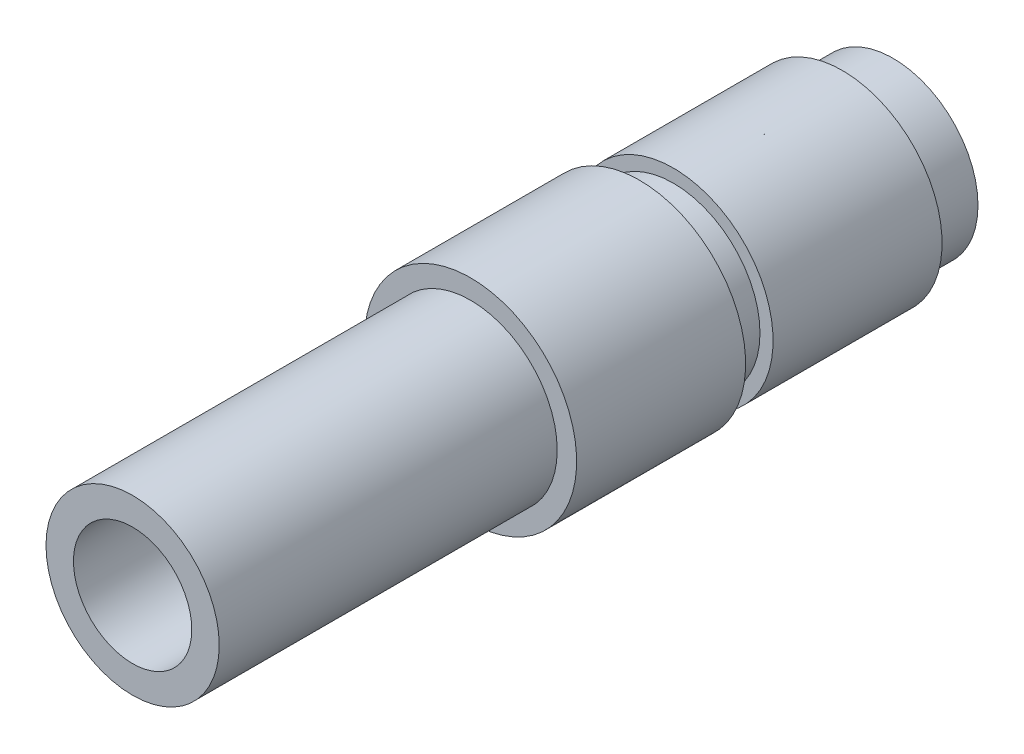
from build123d import *

# Parameters (mm, degrees)
SKETCH1_R          = 2.6035
EXTRUDE2_DEPTH     = 10.16
SKETCH2_R          = 3.1877
EXTRUDE3_DEPTH     = 5.08
SKETCH3_R          = 2.6035
EXTRUDE4_DEPTH     = 1.016
SKETCH4_R          = 2.9972
EXTRUDE5_DEPTH     = 5.08
SKETCH5_R          = 2.5527
EXTRUDE6_DEPTH     = 1.524
SKETCH6_R          = 1.778
CUT_EXTRUDE1_DEPTH = 24.300267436
SKETCH7_R          = 2.1209
CNTR_BORE_DEPTH    = 0.5588


with BuildPart() as part:
    # Sketch1 → Extrude2 (new body)
    with BuildSketch(Plane.XY):
        Circle(SKETCH1_R)
    extrude(amount=-EXTRUDE2_DEPTH)

    # Sketch2 → Extrude3 (add)
    with BuildSketch(Plane(origin=(0, 0, -10.16), x_dir=(-1, 0, 0), z_dir=(0, 0, -1))):
        Circle(SKETCH2_R)
    extrude(amount=EXTRUDE3_DEPTH)

    # Sketch3 → Extrude4 (add)
    with BuildSketch(Plane(origin=(0, 0, -15.24), x_dir=(-1, 0, 0), z_dir=(0, 0, -1))):
        with Locations(Location((0, 0, 0), (0, 0, 180))):
            Circle(SKETCH3_R)
    extrude(amount=EXTRUDE4_DEPTH)

    # Sketch4 → Extrude5 (add)
    with BuildSketch(Plane(origin=(0, 0, -16.256), x_dir=(-1, 0, 0), z_dir=(0, 0, -1))):
        Circle(SKETCH4_R)
    extrude(amount=EXTRUDE5_DEPTH)

    # Sketch5 → Extrude6 (add)
    with BuildSketch(Plane(origin=(0, 0, -21.336), x_dir=(-1, 0, 0), z_dir=(0, 0, -1))):
        with Locations(Location((0, 0, 0), (0, 0, 180))):
            Circle(SKETCH5_R)
    extrude(amount=EXTRUDE6_DEPTH)

    # Sketch6 → Cut-Extrude1 (cut, through all)
    with BuildSketch(Plane.XY):
        Circle(SKETCH6_R)
    extrude(amount=-CUT_EXTRUDE1_DEPTH, mode=Mode.SUBTRACT)

    # Sketch7 → CNTR Bore (cut)
    with BuildSketch(Plane(origin=(0, 0, -22.86), x_dir=(-1, 0, 0), z_dir=(0, 0, -1))):
        Circle(SKETCH7_R)
    extrude(amount=-CNTR_BORE_DEPTH, mode=Mode.SUBTRACT)

    # Sketch9 → 120deg Bevel (revolve, cut)
    with BuildSketch(Plane(origin=(0, 0, 0), x_dir=(0, 0, -1), z_dir=(1, 0, 0)), mode=Mode.PRIVATE) as f_120deg_bevel_sk:
        Polygon((22.3012, 2.1209), (18.627693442, 0), (22.3012, 0), align=None)
    revolve(f_120deg_bevel_sk.sketch.rotate(Axis((0, 0, -22.86), (0, 0, 1)), 90), axis=Axis((0, 0, -22.86), (0, 0, 1)), mode=Mode.SUBTRACT)

    # Lens Seat → Cut-Revolve3 (revolve, cut)
    with BuildSketch(Plane(origin=(0, 0, 0), x_dir=(0, 0, -1), z_dir=(1, 0, 0)), mode=Mode.PRIVATE) as cut_revolve3_sk:
        with BuildLine():
            Line((23.0124, 0), (20.812400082, 0))
            ThreePointArc((20.812400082, 0), (21.262233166, 1.333010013), (22.427778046, 2.1209))
            Line((22.427778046, 2.1209), (22.86, 2.1209))
            Line((22.86, 2.1209), (23.0124, 0))
        make_face()
    revolve(cut_revolve3_sk.sketch.rotate(Axis((0, 0, 0), (0, 0, -1)), 270), axis=Axis((0, 0, 0), (0, 0, -1)), mode=Mode.SUBTRACT)


solid = part.part
